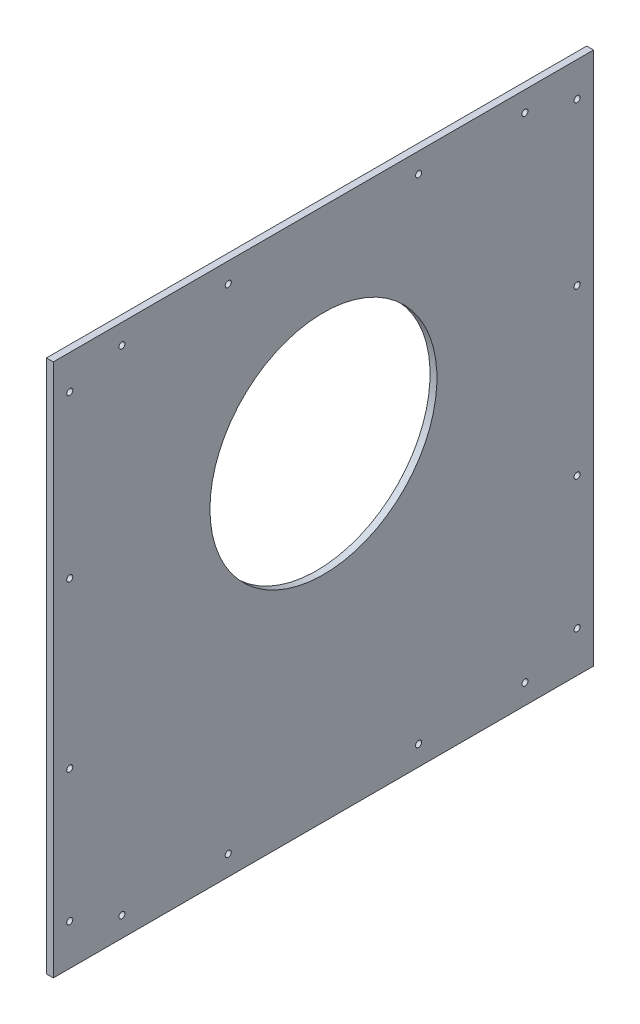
from build123d import *

# Parameters (mm, degrees)
SKETCH1_W           = 499.999
SKETCH1_H           = 544.576
BOSS_EXTRUDE1_DEPTH = 6.35
SKETCH2_R           = 2.8067
CUT_EXTRUDE1_DEPTH  = 740.325599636
SKETCH3_R           = 105.029
CUT_EXTRUDE2_DEPTH  = 12.7
SKETCH4_W           = 499.999
SKETCH4_H           = 50.8
TRIM_FOR_BASE_DEPTH = 740.325599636
SKETCH5_R           = 2.8067
CUT_EXTRUDE4_DEPTH  = 740.325599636


with BuildPart() as part:
    # Sketch1 → Boss-Extrude1 (new body)
    with BuildSketch(Plane(origin=(0, 0, 0), x_dir=(0, 0, -1), z_dir=(1, 0, 0))):
        with Locations((249.9995, 272.288)):
            Rectangle(SKETCH1_W, SKETCH1_H)
    extrude(amount=BOSS_EXTRUDE1_DEPTH)

    # Sketch2 → Cut-Extrude1 (cut, through all)
    with BuildSketch(Plane(origin=(6.35, 0, 0), x_dir=(0, 0, -1), z_dir=(1, 0, 0))):
        with Locations((15.239999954, 512.826)):
            Circle(SKETCH2_R)
        with Locations(Location((484.759000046, 512.826, 0), (0, 0, 180))):
            Circle(SKETCH2_R)
        with Locations((63.5, 526.034)):
            Circle(SKETCH2_R)
        with Locations((15.24, 363.474)):
            Circle(SKETCH2_R)
        with Locations((161.925, 526.034)):
            Circle(SKETCH2_R)
        with Locations((338.074, 526.034)):
            Circle(SKETCH2_R)
        with Locations((484.759, 363.474)):
            Circle(SKETCH2_R)
        with Locations((436.499, 526.034)):
            Circle(SKETCH2_R)
        with Locations((484.759, 211.074)):
            Circle(SKETCH2_R)
        with Locations((484.759, 88.677736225)):
            Circle(SKETCH2_R)
        with Locations((15.24, 211.074)):
            Circle(SKETCH2_R)
        with Locations((15.24, 88.677736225)):
            Circle(SKETCH2_R)
    extrude(amount=-CUT_EXTRUDE1_DEPTH, mode=Mode.SUBTRACT)

    # Sketch3 → Cut-Extrude2 (cut)
    with BuildSketch(Plane.ZY):
        with Locations((-249.9995, 354.076)):
            Circle(SKETCH3_R)
    extrude(amount=-CUT_EXTRUDE2_DEPTH, mode=Mode.SUBTRACT)

    # Sketch4 → trim for base (cut, through all)
    with BuildSketch(Plane.ZY):
        with Locations((-249.9995, 25.4)):
            Rectangle(SKETCH4_W, SKETCH4_H)
    extrude(amount=-TRIM_FOR_BASE_DEPTH, mode=Mode.SUBTRACT)

    # Sketch5 → Cut-Extrude4 (cut, through all)
    with BuildSketch(Plane.ZY):
        with Locations((-436.499, 69.342)):
            Circle(SKETCH5_R)
        with Locations((-338.074, 69.342)):
            Circle(SKETCH5_R)
        with Locations((-161.925, 69.342)):
            Circle(SKETCH5_R)
        with Locations((-63.5, 69.342)):
            Circle(SKETCH5_R)
    extrude(amount=-CUT_EXTRUDE4_DEPTH, mode=Mode.SUBTRACT)


solid = part.part
